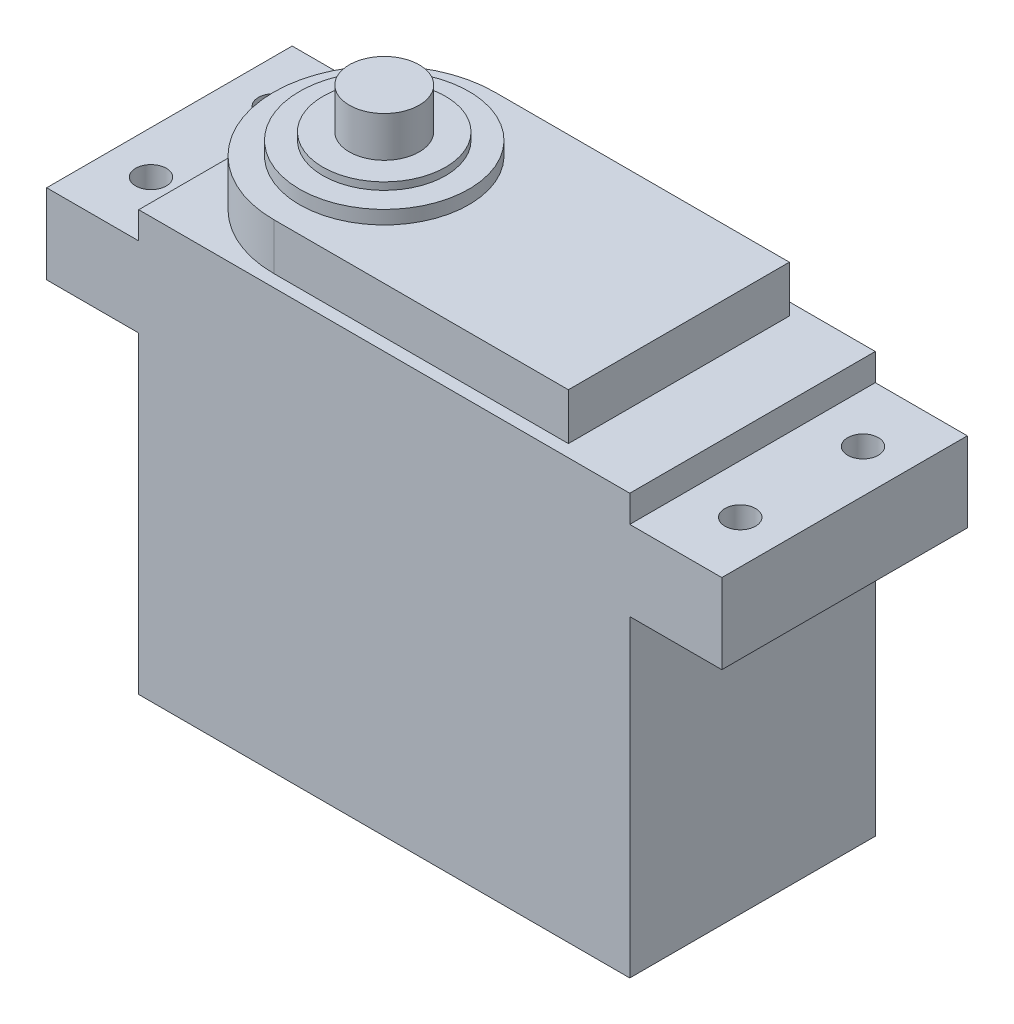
from build123d import *

# Parameters (mm, degrees)
EXTRUSION1_DEPTH        = 10
ESQUISSE2_R             = 1.25
ENL_V_MAT_EXTRU_1_DEPTH = 59.139917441
EXTRUSION2_DEPTH        = 3.8
ESQUISSE4_R             = 6.9
EXTRUSION3_DEPTH        = 1.1
ESQUISSE5_R             = 5
EXTRUSION4_DEPTH        = 0.6
ESQUISSE8_R             = 2.85
BOSS_EXTRU_1_DEPTH      = 3.3
ESQUISSE9_W             = 6
ESQUISSE9_H             = 3
BOSS_EXTRU_2_DEPTH      = 0.5
ESQUISSE10_R            = 0.65
BOSS_EXTRU_3_DEPTH      = 5


with BuildPart() as part:
    # Esquisse1 → Extrusion1 (new, symmetric)
    with BuildSketch(Plane.XY):
        Polygon((47.5, 32), (40, 32), (40, 34.2), (0, 34.2), (0, 32), (-7.5, 32), (-7.5, 25.5), (0, 25.5), (0, 0), (40, 0), (40, 25.5), (47.5, 25.5), align=None)
    extrude(amount=EXTRUSION1_DEPTH, both=True)

    # Esquisse2 → Enl_v. mat.-Extru.1 (cut, through all)
    with BuildSketch(Plane(origin=(0, 32, 0), x_dir=(1, 0, 0), z_dir=(0, 1, 0))):
        with Locations(Location((-4, 5, 0), (0, 0, 270))):
            Circle(ESQUISSE2_R)
        with Locations(Location((-4, -5, 0), (0, 0, 270))):
            Circle(ESQUISSE2_R)
        with Locations(Location((44, -5, 0), (0, 0, 270))):
            Circle(ESQUISSE2_R)
        with Locations(Location((44, 5, 0), (0, 0, 270))):
            Circle(ESQUISSE2_R)
    extrude(amount=-ENL_V_MAT_EXTRU_1_DEPTH, mode=Mode.SUBTRACT)

    # Esquisse3 → Extrusion2 (add)
    with BuildSketch(Plane(origin=(0, 34.2, 0), x_dir=(1, 0, 0), z_dir=(0, 1, 0))):
        with BuildLine():
            Line((10, 9), (34, 9))
            Line((34, 9), (34, -9))
            Line((34, -9), (10, -9))
            ThreePointArc((10, -9), (1, 0), (10, 9))
        make_face()
    extrude(amount=EXTRUSION2_DEPTH)

    # Esquisse4 → Extrusion3 (add)
    with BuildSketch(Plane(origin=(0, 38, 0), x_dir=(1, 0, 0), z_dir=(0, 1, 0))):
        with Locations(Location((10, 0, 0), (0, 0, 270))):
            Circle(ESQUISSE4_R)
    extrude(amount=EXTRUSION3_DEPTH)

    # Esquisse5 → Extrusion4 (add)
    with BuildSketch(Plane(origin=(0, 39.1, 0), x_dir=(1, 0, 0), z_dir=(0, 1, 0))):
        with Locations(Location((10, 0, 0), (0, 0, 270))):
            Circle(ESQUISSE5_R)
    extrude(amount=EXTRUSION4_DEPTH)

    # Esquisse8 → Boss.-Extru.1 (add)
    with BuildSketch(Plane(origin=(0, 39.7, 0), x_dir=(1, 0, 0), z_dir=(0, 1, 0))):
        with Locations(Location((10, 0, 0), (0, 0, 270))):
            Circle(ESQUISSE8_R)
    extrude(amount=BOSS_EXTRU_1_DEPTH)

    # Esquisse9 → Boss.-Extru.2 (add)
    with BuildSketch(Plane.ZY):
        with Locations((0, 2)):
            Rectangle(ESQUISSE9_W, ESQUISSE9_H)
    extrude(amount=BOSS_EXTRU_2_DEPTH)

    # Esquisse10 → Boss.-Extru.3 (add)
    with BuildSketch(Plane.ZY.offset(0.5)):
        with Locations((-1.31, 2)):
            Circle(ESQUISSE10_R)
        with Locations((0, 2)):
            Circle(ESQUISSE10_R)
        with Locations((1.31, 2)):
            Circle(ESQUISSE10_R)
    extrude(amount=BOSS_EXTRU_3_DEPTH)


solid = part.part
